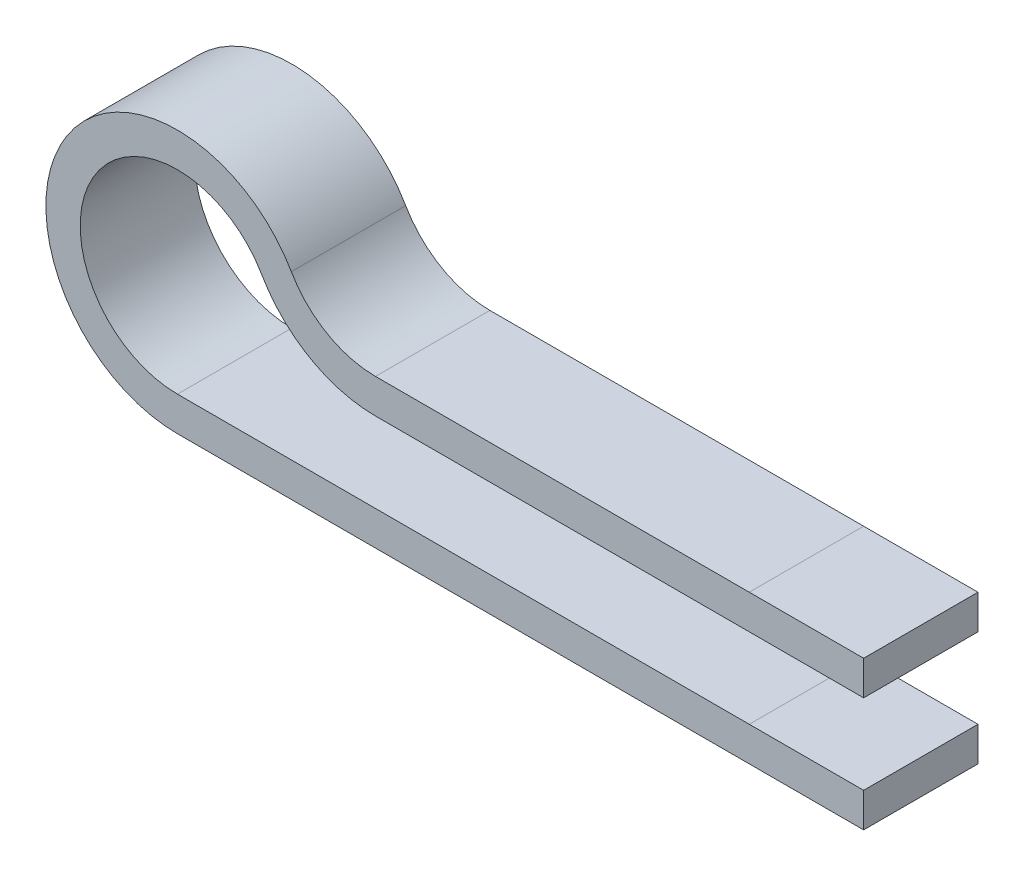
from build123d import *

# Parameters (mm, degrees)
SKETCH2_W = 5
SKETCH2_H = 1.5


with BuildPart() as part:
    # Base-Sweep: sweep along a path in Sketch1
    with BuildLine(Plane.XY) as base_sweep_path:
        Line((30, 0), (0, 0))
        ThreePointArc((0, 0), (-4.330127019, 7.5), (4.330127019, 7.5))
        ThreePointArc((4.330127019, 7.5), (6.160254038, 5.669872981), (8.660254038, 5))
        Line((8.660254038, 5), (30, 5))
    # Sketch2 → Base-Sweep (sweep)
    with BuildSketch(Plane(origin=(30, 0, 0), x_dir=(0, 0, -1), z_dir=(1, 0, 0))):
        Rectangle(SKETCH2_W, SKETCH2_H)
    sweep(path=base_sweep_path.line)


solid = part.part
